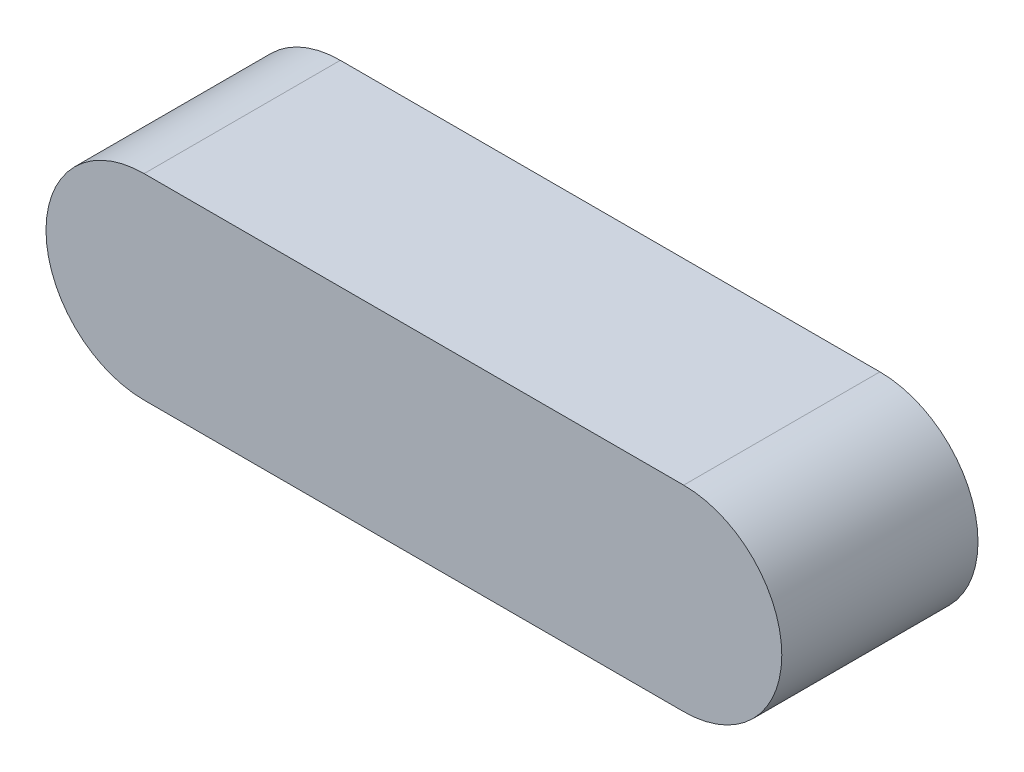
ISO-10303-21;
HEADER;
FILE_DESCRIPTION(('STEP AP214'),'2;1');
FILE_NAME('part.step','',(''),(''),'','','');
FILE_SCHEMA(('AUTOMOTIVE_DESIGN { 1 0 10303 214 1 1 1 1 }'));
ENDSEC;
DATA;
#1=APPLICATION_CONTEXT('core data for automotive mechanical design processes');
#2=APPLICATION_PROTOCOL_DEFINITION('international standard','automotive_design',2000,#1);
#3=PRODUCT_CONTEXT('',#1,'mechanical');
#4=PRODUCT('Part','Part','',(#3));
#5=PRODUCT_RELATED_PRODUCT_CATEGORY('part','',(#4));
#6=PRODUCT_DEFINITION_FORMATION('','',#4);
#7=PRODUCT_DEFINITION_CONTEXT('part definition',#1,'design');
#8=PRODUCT_DEFINITION('design','',#6,#7);
#9=PRODUCT_DEFINITION_SHAPE('','',#8);
#10=(LENGTH_UNIT() NAMED_UNIT(*) SI_UNIT(.MILLI.,.METRE.));
#11=(NAMED_UNIT(*) PLANE_ANGLE_UNIT() SI_UNIT($,.RADIAN.));
#12=(NAMED_UNIT(*) SI_UNIT($,.STERADIAN.) SOLID_ANGLE_UNIT());
#13=UNCERTAINTY_MEASURE_WITH_UNIT(LENGTH_MEASURE(1.E-05),#10,'distance_accuracy_value','');
#14=(GEOMETRIC_REPRESENTATION_CONTEXT(3) GLOBAL_UNCERTAINTY_ASSIGNED_CONTEXT((#13)) GLOBAL_UNIT_ASSIGNED_CONTEXT((#10,
#11,#12)) REPRESENTATION_CONTEXT('',''));
#15=CARTESIAN_POINT('',(0.,0.,0.));
#16=DIRECTION('',(0.,0.,1.));
#17=DIRECTION('',(1.,0.,0.));
#18=AXIS2_PLACEMENT_3D('',#15,#16,#17);
#19=CARTESIAN_POINT('',(0.,0.,4.));
#20=DIRECTION('',(0.,0.,-1.));
#21=DIRECTION('',(-1.,0.,0.));
#22=AXIS2_PLACEMENT_3D('',#19,#20,#21);
#23=CYLINDRICAL_SURFACE('',#22,2.);
#24=CARTESIAN_POINT('',(0.,0.,0.));
#25=DIRECTION('',(0.,0.,1.));
#26=DIRECTION('',(1.,0.,0.));
#27=AXIS2_PLACEMENT_3D('',#24,#25,#26);
#28=CIRCLE('',#27,2.);
#29=CARTESIAN_POINT('',(0.,2.,0.));
#30=VERTEX_POINT('',#29);
#31=CARTESIAN_POINT('',(0.,-2.,0.));
#32=VERTEX_POINT('',#31);
#33=EDGE_CURVE('E68',#30,#32,#28,.T.);
#34=ORIENTED_EDGE('',*,*,#33,.T.);
#35=DIRECTION('',(0.,0.,-1.));
#36=VECTOR('',#35,1.);
#37=CARTESIAN_POINT('',(0.,-2.,4.));
#38=LINE('',#37,#36);
#39=CARTESIAN_POINT('',(0.,-2.,4.));
#40=VERTEX_POINT('',#39);
#41=EDGE_CURVE('E11',#40,#32,#38,.T.);
#42=ORIENTED_EDGE('',*,*,#41,.F.);
#43=CARTESIAN_POINT('',(0.,0.,4.));
#44=DIRECTION('',(0.,0.,1.));
#45=DIRECTION('',(1.,0.,0.));
#46=AXIS2_PLACEMENT_3D('',#43,#44,#45);
#47=CIRCLE('',#46,2.);
#48=CARTESIAN_POINT('',(0.,2.,4.));
#49=VERTEX_POINT('',#48);
#50=EDGE_CURVE('E86',#49,#40,#47,.T.);
#51=ORIENTED_EDGE('',*,*,#50,.F.);
#52=DIRECTION('',(0.,0.,-1.));
#53=VECTOR('',#52,1.);
#54=CARTESIAN_POINT('',(0.,2.,4.));
#55=LINE('',#54,#53);
#56=EDGE_CURVE('E80',#49,#30,#55,.T.);
#57=ORIENTED_EDGE('',*,*,#56,.T.);
#58=EDGE_LOOP('',(#34,#42,#51,#57));
#59=FACE_BOUND('',#58,.T.);
#60=ADVANCED_FACE('F24',(#59),#23,.T.);
#61=CARTESIAN_POINT('',(0.,-2.,4.));
#62=DIRECTION('',(0.,1.,0.));
#63=DIRECTION('',(-1.,0.,0.));
#64=AXIS2_PLACEMENT_3D('',#61,#62,#63);
#65=PLANE('',#64);
#66=DIRECTION('',(1.,0.,0.));
#67=VECTOR('',#66,1.);
#68=CARTESIAN_POINT('',(0.,-2.,0.));
#69=LINE('',#68,#67);
#70=CARTESIAN_POINT('',(11.,-2.,0.));
#71=VERTEX_POINT('',#70);
#72=EDGE_CURVE('E64',#32,#71,#69,.T.);
#73=ORIENTED_EDGE('',*,*,#72,.T.);
#74=DIRECTION('',(0.,0.,-1.));
#75=VECTOR('',#74,1.);
#76=CARTESIAN_POINT('',(11.,-2.,4.));
#77=LINE('',#76,#75);
#78=CARTESIAN_POINT('',(11.,-2.,4.));
#79=VERTEX_POINT('',#78);
#80=EDGE_CURVE('E31',#79,#71,#77,.T.);
#81=ORIENTED_EDGE('',*,*,#80,.F.);
#82=DIRECTION('',(1.,0.,0.));
#83=VECTOR('',#82,1.);
#84=CARTESIAN_POINT('',(0.,-2.,4.));
#85=LINE('',#84,#83);
#86=EDGE_CURVE('E76',#40,#79,#85,.T.);
#87=ORIENTED_EDGE('',*,*,#86,.F.);
#88=ORIENTED_EDGE('',*,*,#41,.T.);
#89=EDGE_LOOP('',(#73,#81,#87,#88));
#90=FACE_BOUND('',#89,.T.);
#91=ADVANCED_FACE('F75',(#90),#65,.F.);
#92=CARTESIAN_POINT('',(11.,0.,4.));
#93=DIRECTION('',(0.,0.,-1.));
#94=DIRECTION('',(-1.,0.,0.));
#95=AXIS2_PLACEMENT_3D('',#92,#93,#94);
#96=CYLINDRICAL_SURFACE('',#95,2.);
#97=CARTESIAN_POINT('',(11.,0.,0.));
#98=DIRECTION('',(0.,0.,1.));
#99=DIRECTION('',(1.,0.,0.));
#100=AXIS2_PLACEMENT_3D('',#97,#98,#99);
#101=CIRCLE('',#100,2.);
#102=CARTESIAN_POINT('',(10.9999999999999,2.,0.));
#103=VERTEX_POINT('',#102);
#104=EDGE_CURVE('E69',#71,#103,#101,.T.);
#105=ORIENTED_EDGE('',*,*,#104,.T.);
#106=DIRECTION('',(0.,0.,-1.));
#107=VECTOR('',#106,1.);
#108=CARTESIAN_POINT('',(10.9999999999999,2.,4.));
#109=LINE('',#108,#107);
#110=CARTESIAN_POINT('',(10.9999999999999,2.,4.));
#111=VERTEX_POINT('',#110);
#112=EDGE_CURVE('E92',#111,#103,#109,.T.);
#113=ORIENTED_EDGE('',*,*,#112,.F.);
#114=CARTESIAN_POINT('',(11.,0.,4.));
#115=DIRECTION('',(0.,0.,1.));
#116=DIRECTION('',(1.,0.,0.));
#117=AXIS2_PLACEMENT_3D('',#114,#115,#116);
#118=CIRCLE('',#117,2.);
#119=EDGE_CURVE('E43',#79,#111,#118,.T.);
#120=ORIENTED_EDGE('',*,*,#119,.F.);
#121=ORIENTED_EDGE('',*,*,#80,.T.);
#122=EDGE_LOOP('',(#105,#113,#120,#121));
#123=FACE_BOUND('',#122,.T.);
#124=ADVANCED_FACE('F95',(#123),#96,.T.);
#125=CARTESIAN_POINT('',(0.,2.,4.));
#126=DIRECTION('',(0.,-1.,0.));
#127=DIRECTION('',(1.,0.,0.));
#128=AXIS2_PLACEMENT_3D('',#125,#126,#127);
#129=PLANE('',#128);
#130=DIRECTION('',(-1.,0.,0.));
#131=VECTOR('',#130,1.);
#132=CARTESIAN_POINT('',(0.,2.,0.));
#133=LINE('',#132,#131);
#134=EDGE_CURVE('E84',#103,#30,#133,.T.);
#135=ORIENTED_EDGE('',*,*,#134,.T.);
#136=ORIENTED_EDGE('',*,*,#56,.F.);
#137=DIRECTION('',(-1.,0.,0.));
#138=VECTOR('',#137,1.);
#139=CARTESIAN_POINT('',(0.,2.,4.));
#140=LINE('',#139,#138);
#141=EDGE_CURVE('E38',#111,#49,#140,.T.);
#142=ORIENTED_EDGE('',*,*,#141,.F.);
#143=ORIENTED_EDGE('',*,*,#112,.T.);
#144=EDGE_LOOP('',(#135,#136,#142,#143));
#145=FACE_BOUND('',#144,.T.);
#146=ADVANCED_FACE('F97',(#145),#129,.F.);
#147=CARTESIAN_POINT('',(0.,0.,4.));
#148=DIRECTION('',(0.,0.,1.));
#149=DIRECTION('',(1.,0.,0.));
#150=AXIS2_PLACEMENT_3D('',#147,#148,#149);
#151=PLANE('',#150);
#152=ORIENTED_EDGE('',*,*,#50,.T.);
#153=ORIENTED_EDGE('',*,*,#86,.T.);
#154=ORIENTED_EDGE('',*,*,#119,.T.);
#155=ORIENTED_EDGE('',*,*,#141,.T.);
#156=EDGE_LOOP('',(#152,#153,#154,#155));
#157=FACE_BOUND('',#156,.T.);
#158=ADVANCED_FACE('F98',(#157),#151,.T.);
#159=CARTESIAN_POINT('',(0.,0.,0.));
#160=DIRECTION('',(0.,0.,1.));
#161=DIRECTION('',(1.,0.,0.));
#162=AXIS2_PLACEMENT_3D('',#159,#160,#161);
#163=PLANE('',#162);
#164=ORIENTED_EDGE('',*,*,#33,.F.);
#165=ORIENTED_EDGE('',*,*,#134,.F.);
#166=ORIENTED_EDGE('',*,*,#104,.F.);
#167=ORIENTED_EDGE('',*,*,#72,.F.);
#168=EDGE_LOOP('',(#164,#165,#166,#167));
#169=FACE_BOUND('',#168,.T.);
#170=ADVANCED_FACE('F65',(#169),#163,.F.);
#171=CLOSED_SHELL('',(#60,#91,#124,#146,#158,#170));
#172=MANIFOLD_SOLID_BREP('B2',#171);
#173=ADVANCED_BREP_SHAPE_REPRESENTATION('',(#18,#172),#14);
#174=SHAPE_DEFINITION_REPRESENTATION(#9,#173);
ENDSEC;
END-ISO-10303-21;
